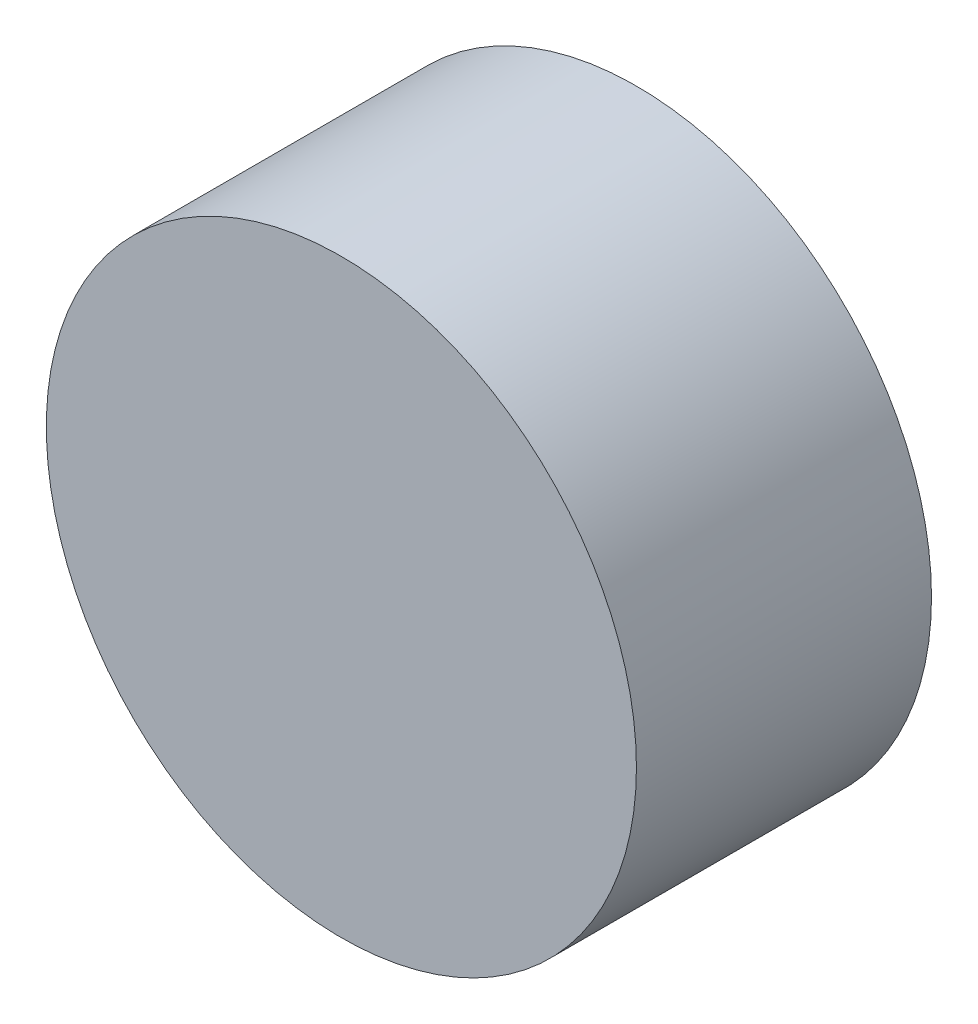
ISO-10303-21;
HEADER;
FILE_DESCRIPTION(('STEP AP214'),'2;1');
FILE_NAME('part.step','',(''),(''),'','','');
FILE_SCHEMA(('AUTOMOTIVE_DESIGN { 1 0 10303 214 1 1 1 1 }'));
ENDSEC;
DATA;
#1=APPLICATION_CONTEXT('core data for automotive mechanical design processes');
#2=APPLICATION_PROTOCOL_DEFINITION('international standard','automotive_design',2000,#1);
#3=PRODUCT_CONTEXT('',#1,'mechanical');
#4=PRODUCT('Part','Part','',(#3));
#5=PRODUCT_RELATED_PRODUCT_CATEGORY('part','',(#4));
#6=PRODUCT_DEFINITION_FORMATION('','',#4);
#7=PRODUCT_DEFINITION_CONTEXT('part definition',#1,'design');
#8=PRODUCT_DEFINITION('design','',#6,#7);
#9=PRODUCT_DEFINITION_SHAPE('','',#8);
#10=(LENGTH_UNIT() NAMED_UNIT(*) SI_UNIT(.MILLI.,.METRE.));
#11=(NAMED_UNIT(*) PLANE_ANGLE_UNIT() SI_UNIT($,.RADIAN.));
#12=(NAMED_UNIT(*) SI_UNIT($,.STERADIAN.) SOLID_ANGLE_UNIT());
#13=UNCERTAINTY_MEASURE_WITH_UNIT(LENGTH_MEASURE(1.E-05),#10,'distance_accuracy_value','');
#14=(GEOMETRIC_REPRESENTATION_CONTEXT(3) GLOBAL_UNCERTAINTY_ASSIGNED_CONTEXT((#13)) GLOBAL_UNIT_ASSIGNED_CONTEXT((#10,
#11,#12)) REPRESENTATION_CONTEXT('',''));
#15=CARTESIAN_POINT('',(0.,0.,0.));
#16=DIRECTION('',(0.,0.,1.));
#17=DIRECTION('',(1.,0.,0.));
#18=AXIS2_PLACEMENT_3D('',#15,#16,#17);
#19=CARTESIAN_POINT('',(0.,0.,30.));
#20=DIRECTION('',(0.,0.,1.));
#21=DIRECTION('',(1.,0.,0.));
#22=AXIS2_PLACEMENT_3D('',#19,#20,#21);
#23=CYLINDRICAL_SURFACE('',#22,10.);
#24=CARTESIAN_POINT('',(0.,0.,10.));
#25=DIRECTION('',(0.,0.,1.));
#26=DIRECTION('',(1.,0.,0.));
#27=AXIS2_PLACEMENT_3D('',#24,#25,#26);
#28=CIRCLE('',#27,10.);
#29=CARTESIAN_POINT('',(10.,0.,10.));
#30=VERTEX_POINT('',#29);
#31=EDGE_CURVE('E8',#30,#30,#28,.T.);
#32=ORIENTED_EDGE('',*,*,#31,.F.);
#33=EDGE_LOOP('',(#32));
#34=FACE_BOUND('',#33,.T.);
#35=CARTESIAN_POINT('',(0.,0.,0.));
#36=DIRECTION('',(0.,0.,1.));
#37=DIRECTION('',(1.,0.,0.));
#38=AXIS2_PLACEMENT_3D('',#35,#36,#37);
#39=CIRCLE('',#38,10.);
#40=CARTESIAN_POINT('',(10.,0.,0.));
#41=VERTEX_POINT('',#40);
#42=EDGE_CURVE('E27',#41,#41,#39,.T.);
#43=ORIENTED_EDGE('',*,*,#42,.T.);
#44=EDGE_LOOP('',(#43));
#45=FACE_BOUND('',#44,.T.);
#46=ADVANCED_FACE('F13',(#34,#45),#23,.T.);
#47=CARTESIAN_POINT('',(10.,0.,10.));
#48=DIRECTION('',(0.,0.,-1.));
#49=DIRECTION('',(-1.,0.,0.));
#50=AXIS2_PLACEMENT_3D('',#47,#48,#49);
#51=PLANE('',#50);
#52=ORIENTED_EDGE('',*,*,#31,.T.);
#53=EDGE_LOOP('',(#52));
#54=FACE_BOUND('',#53,.T.);
#55=ADVANCED_FACE('F49',(#54),#51,.F.);
#56=CARTESIAN_POINT('',(0.,0.,5.));
#57=DIRECTION('',(0.,0.,1.));
#58=DIRECTION('',(1.,0.,0.));
#59=AXIS2_PLACEMENT_3D('',#56,#57,#58);
#60=PLANE('',#59);
#61=CARTESIAN_POINT('',(0.,0.,5.));
#62=DIRECTION('',(0.,0.,1.));
#63=DIRECTION('',(1.,0.,0.));
#64=AXIS2_PLACEMENT_3D('',#61,#62,#63);
#65=CIRCLE('',#64,3.);
#66=CARTESIAN_POINT('',(3.,0.,5.));
#67=VERTEX_POINT('',#66);
#68=EDGE_CURVE('E19',#67,#67,#65,.T.);
#69=ORIENTED_EDGE('',*,*,#68,.F.);
#70=EDGE_LOOP('',(#69));
#71=FACE_BOUND('',#70,.T.);
#72=ADVANCED_FACE('F42',(#71),#60,.F.);
#73=CARTESIAN_POINT('',(0.,0.,30.));
#74=DIRECTION('',(0.,0.,1.));
#75=DIRECTION('',(1.,0.,0.));
#76=AXIS2_PLACEMENT_3D('',#73,#74,#75);
#77=CYLINDRICAL_SURFACE('',#76,3.);
#78=CARTESIAN_POINT('',(0.,0.,0.));
#79=DIRECTION('',(0.,0.,1.));
#80=DIRECTION('',(1.,0.,0.));
#81=AXIS2_PLACEMENT_3D('',#78,#79,#80);
#82=CIRCLE('',#81,3.);
#83=CARTESIAN_POINT('',(3.,0.,0.));
#84=VERTEX_POINT('',#83);
#85=EDGE_CURVE('E23',#84,#84,#82,.T.);
#86=ORIENTED_EDGE('',*,*,#85,.F.);
#87=EDGE_LOOP('',(#86));
#88=FACE_BOUND('',#87,.T.);
#89=ORIENTED_EDGE('',*,*,#68,.T.);
#90=EDGE_LOOP('',(#89));
#91=FACE_BOUND('',#90,.T.);
#92=ADVANCED_FACE('F37',(#88,#91),#77,.F.);
#93=CARTESIAN_POINT('',(3.,0.,0.));
#94=DIRECTION('',(0.,0.,1.));
#95=DIRECTION('',(1.,0.,0.));
#96=AXIS2_PLACEMENT_3D('',#93,#94,#95);
#97=PLANE('',#96);
#98=ORIENTED_EDGE('',*,*,#42,.F.);
#99=EDGE_LOOP('',(#98));
#100=FACE_BOUND('',#99,.T.);
#101=ORIENTED_EDGE('',*,*,#85,.T.);
#102=EDGE_LOOP('',(#101));
#103=FACE_BOUND('',#102,.T.);
#104=ADVANCED_FACE('F34',(#100,#103),#97,.F.);
#105=CLOSED_SHELL('',(#46,#55,#72,#92,#104));
#106=MANIFOLD_SOLID_BREP('B1',#105);
#107=ADVANCED_BREP_SHAPE_REPRESENTATION('',(#18,#106),#14);
#108=SHAPE_DEFINITION_REPRESENTATION(#9,#107);
ENDSEC;
END-ISO-10303-21;
